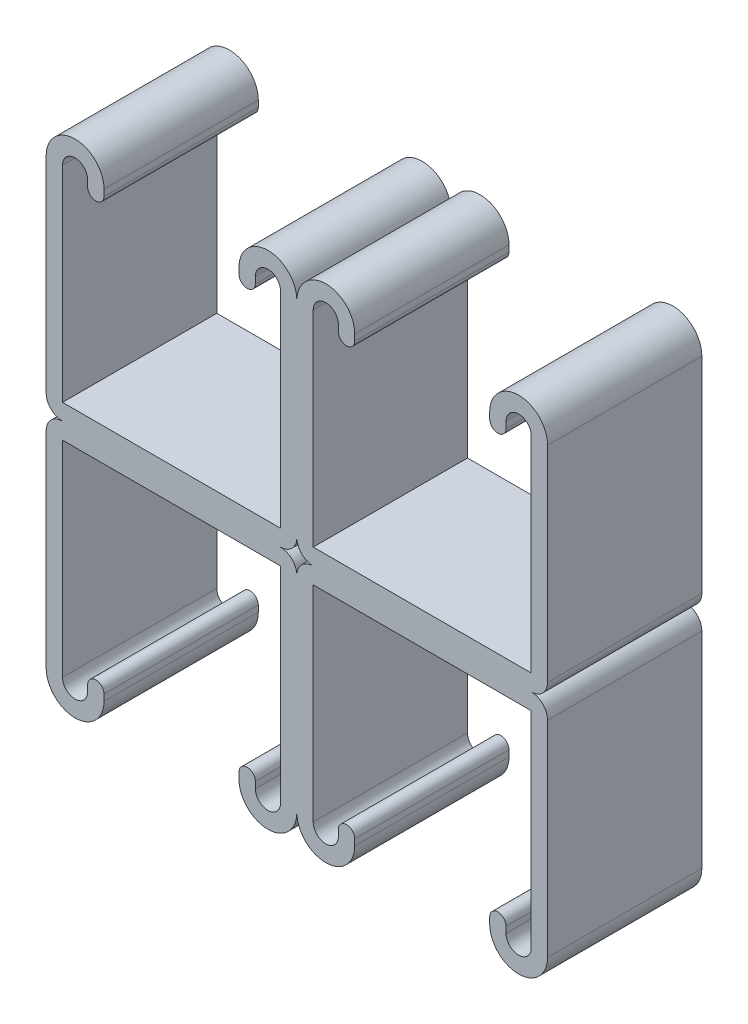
from build123d import *

# Parameters (mm, degrees)
BASE_EXTRUDE_DEPTH   = 12.7
MIRROR2_COPY_1_DEPTH = 12.7


with BuildPart() as part:
    # Sketch1 → Base-Extrude (new, symmetric)
    with BuildSketch(Plane.XY):
        with BuildLine():
            Line((0, 36.5125), (0, 2.6924))
            ThreePointArc((0, 2.6924), (0.788585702, 0.788585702), (2.6924, 0))
            Line((2.6924, 0), (38.5826, 0))
            ThreePointArc((38.5826, 0), (40.486414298, 0.788585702), (41.275, 2.6924))
            Line((41.275, 2.6924), (41.275, 36.5125))
            ThreePointArc((41.275, 36.5125), (36.5125, 41.275), (31.75, 36.5125))
            Line((31.75, 36.5125), (31.75, 35.47745))
            ThreePointArc((31.75, 35.47745), (33.0962, 34.13125), (34.4424, 35.47745))
            Line((34.4424, 35.47745), (34.4424, 36.5125))
            ThreePointArc((34.4424, 36.5125), (36.5125, 38.5826), (38.5826, 36.5125))
            Line((38.5826, 36.5125), (38.5826, 2.6924))
            Line((38.5826, 2.6924), (2.6924, 2.6924))
            Line((2.6924, 2.6924), (2.6924, 36.5125))
            ThreePointArc((2.6924, 36.5125), (4.7625, 38.5826), (6.8326, 36.5125))
            Line((6.8326, 36.5125), (6.8326, 35.47745))
            ThreePointArc((6.8326, 35.47745), (8.1788, 34.13125), (9.525, 35.47745))
            Line((9.525, 35.47745), (9.525, 36.5125))
            ThreePointArc((9.525, 36.5125), (4.7625, 41.275), (0, 36.5125))
        make_face()
    base_extrude = extrude(amount=BASE_EXTRUDE_DEPTH, both=True)

    # Mirror1: Base-Extrude across plane
    add(base_extrude.mirror(Plane(origin=(0, 0, 0), x_dir=(0, 0, 1), z_dir=(1, 0, 0))))

    # Mirror2: Base-Extrude across plane
    add(base_extrude.mirror(Plane.ZX))

    # Mirror2 copy 1 sketch → Mirror2 copy 1 (add, symmetric)
    with BuildSketch(Plane(origin=(0, 0, 0), x_dir=(-1, 0, 0), z_dir=(0, 0, 1))):
        with BuildLine():
            Line((0, 36.5125), (0, 2.6924))
            ThreePointArc((0, 2.6924), (0.788585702, 0.788585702), (2.6924, 0))
            Line((2.6924, 0), (38.5826, 0))
            ThreePointArc((38.5826, 0), (40.486414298, 0.788585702), (41.275, 2.6924))
            Line((41.275, 2.6924), (41.275, 36.5125))
            ThreePointArc((41.275, 36.5125), (36.5125, 41.275), (31.75, 36.5125))
            Line((31.75, 36.5125), (31.75, 35.47745))
            ThreePointArc((31.75, 35.47745), (33.0962, 34.13125), (34.4424, 35.47745))
            Line((34.4424, 35.47745), (34.4424, 36.5125))
            ThreePointArc((34.4424, 36.5125), (36.5125, 38.5826), (38.5826, 36.5125))
            Line((38.5826, 36.5125), (38.5826, 2.6924))
            Line((38.5826, 2.6924), (2.6924, 2.6924))
            Line((2.6924, 2.6924), (2.6924, 36.5125))
            ThreePointArc((2.6924, 36.5125), (4.7625, 38.5826), (6.8326, 36.5125))
            Line((6.8326, 36.5125), (6.8326, 35.47745))
            ThreePointArc((6.8326, 35.47745), (8.1788, 34.13125), (9.525, 35.47745))
            Line((9.525, 35.47745), (9.525, 36.5125))
            ThreePointArc((9.525, 36.5125), (4.7625, 41.275), (0, 36.5125))
        make_face()
    extrude(amount=MIRROR2_COPY_1_DEPTH, both=True)


solid = part.part
